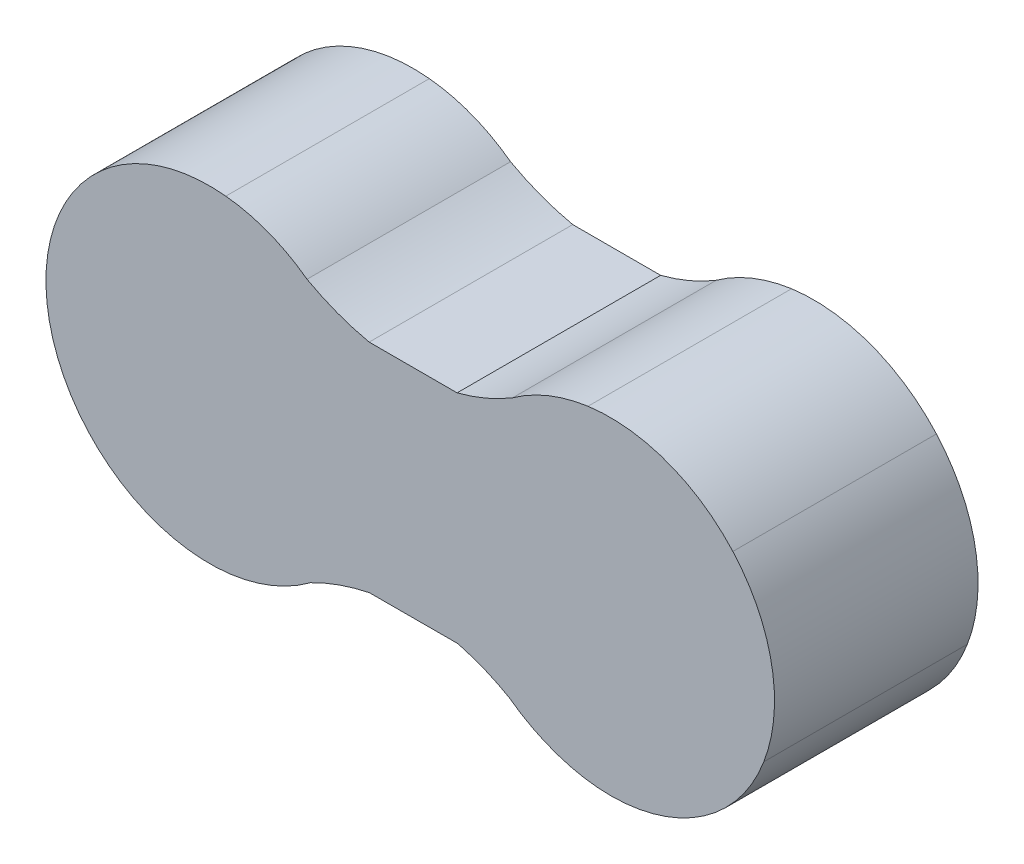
ISO-10303-21;
HEADER;
FILE_DESCRIPTION(('STEP AP214'),'2;1');
FILE_NAME('part.step','',(''),(''),'','','');
FILE_SCHEMA(('AUTOMOTIVE_DESIGN { 1 0 10303 214 1 1 1 1 }'));
ENDSEC;
DATA;
#1=APPLICATION_CONTEXT('core data for automotive mechanical design processes');
#2=APPLICATION_PROTOCOL_DEFINITION('international standard','automotive_design',2000,#1);
#3=PRODUCT_CONTEXT('',#1,'mechanical');
#4=PRODUCT('Part','Part','',(#3));
#5=PRODUCT_RELATED_PRODUCT_CATEGORY('part','',(#4));
#6=PRODUCT_DEFINITION_FORMATION('','',#4);
#7=PRODUCT_DEFINITION_CONTEXT('part definition',#1,'design');
#8=PRODUCT_DEFINITION('design','',#6,#7);
#9=PRODUCT_DEFINITION_SHAPE('','',#8);
#10=(LENGTH_UNIT() NAMED_UNIT(*) SI_UNIT(.MILLI.,.METRE.));
#11=(NAMED_UNIT(*) PLANE_ANGLE_UNIT() SI_UNIT($,.RADIAN.));
#12=(NAMED_UNIT(*) SI_UNIT($,.STERADIAN.) SOLID_ANGLE_UNIT());
#13=UNCERTAINTY_MEASURE_WITH_UNIT(LENGTH_MEASURE(1.E-05),#10,'distance_accuracy_value','');
#14=(GEOMETRIC_REPRESENTATION_CONTEXT(3) GLOBAL_UNCERTAINTY_ASSIGNED_CONTEXT((#13)) GLOBAL_UNIT_ASSIGNED_CONTEXT((#10,
#11,#12)) REPRESENTATION_CONTEXT('',''));
#15=CARTESIAN_POINT('',(0.,0.,0.));
#16=DIRECTION('',(0.,0.,1.));
#17=DIRECTION('',(1.,0.,0.));
#18=AXIS2_PLACEMENT_3D('',#15,#16,#17);
#19=CARTESIAN_POINT('',(0.,0.,0.508));
#20=DIRECTION('',(0.,0.,1.));
#21=DIRECTION('',(1.,0.,0.));
#22=AXIS2_PLACEMENT_3D('',#19,#20,#21);
#23=PLANE('',#22);
#24=CARTESIAN_POINT('',(0.0182368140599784,0.824100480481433,0.508));
#25=DIRECTION('',(0.,0.,1.));
#26=DIRECTION('',(1.,0.,0.));
#27=AXIS2_PLACEMENT_3D('',#24,#25,#26);
#28=CIRCLE('',#27,0.567659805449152);
#29=CARTESIAN_POINT('',(-0.256661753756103,0.327443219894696,0.508));
#30=VERTEX_POINT('',#29);
#31=CARTESIAN_POINT('',(-0.101460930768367,0.2692039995,0.508));
#32=VERTEX_POINT('',#31);
#33=EDGE_CURVE('E246',#30,#32,#28,.T.);
#34=ORIENTED_EDGE('',*,*,#33,.F.);
#35=CARTESIAN_POINT('',(-0.499437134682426,0.000317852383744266,0.508));
#36=DIRECTION('',(0.,0.,1.));
#37=DIRECTION('',(1.,0.,0.));
#38=AXIS2_PLACEMENT_3D('',#35,#36,#37);
#39=CIRCLE('',#38,0.407370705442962);
#40=CARTESIAN_POINT('',(-0.459355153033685,0.405711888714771,0.508));
#41=VERTEX_POINT('',#40);
#42=EDGE_CURVE('E251',#41,#30,#39,.F.);
#43=ORIENTED_EDGE('',*,*,#42,.F.);
#44=CARTESIAN_POINT('',(-0.500191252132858,0.00113089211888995,0.508));
#45=DIRECTION('',(0.,0.,1.));
#46=DIRECTION('',(1.,0.,0.));
#47=AXIS2_PLACEMENT_3D('',#44,#45,#46);
#48=CIRCLE('',#47,0.406636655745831);
#49=CARTESIAN_POINT('',(-0.77121801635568,0.304277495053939,0.508));
#50=VERTEX_POINT('',#49);
#51=EDGE_CURVE('E181',#50,#41,#48,.F.);
#52=ORIENTED_EDGE('',*,*,#51,.F.);
#53=CARTESIAN_POINT('',(-0.497390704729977,-0.0020015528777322,0.508));
#54=DIRECTION('',(0.,0.,1.));
#55=DIRECTION('',(1.,0.,0.));
#56=AXIS2_PLACEMENT_3D('',#53,#54,#55);
#57=CIRCLE('',#56,0.410838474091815);
#58=CARTESIAN_POINT('',(-0.907425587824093,0.0236820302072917,0.508));
#59=VERTEX_POINT('',#58);
#60=EDGE_CURVE('E178',#59,#50,#57,.F.);
#61=ORIENTED_EDGE('',*,*,#60,.F.);
#62=CARTESIAN_POINT('',(-0.502358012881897,-0.00169041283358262,0.508));
#63=DIRECTION('',(0.,0.,1.));
#64=DIRECTION('',(1.,0.,0.));
#65=AXIS2_PLACEMENT_3D('',#62,#63,#64);
#66=CIRCLE('',#65,0.405861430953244);
#67=CARTESIAN_POINT('',(-0.826003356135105,-0.246592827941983,0.508));
#68=VERTEX_POINT('',#67);
#69=EDGE_CURVE('E172',#68,#59,#66,.F.);
#70=ORIENTED_EDGE('',*,*,#69,.F.);
#71=CARTESIAN_POINT('',(-0.499808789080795,0.00023858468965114,0.508));
#72=DIRECTION('',(0.,0.,1.));
#73=DIRECTION('',(1.,0.,0.));
#74=AXIS2_PLACEMENT_3D('',#71,#72,#73);
#75=CIRCLE('',#74,0.409058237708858);
#76=CARTESIAN_POINT('',(-0.377106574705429,-0.389982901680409,0.508));
#77=VERTEX_POINT('',#76);
#78=EDGE_CURVE('E188',#77,#68,#75,.F.);
#79=ORIENTED_EDGE('',*,*,#78,.F.);
#80=CARTESIAN_POINT('',(-0.507623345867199,0.0250906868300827,0.508));
#81=DIRECTION('',(0.,0.,1.));
#82=DIRECTION('',(1.,0.,0.));
#83=AXIS2_PLACEMENT_3D('',#80,#81,#82);
#84=CIRCLE('',#83,0.435109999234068);
#85=CARTESIAN_POINT('',(-0.247996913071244,-0.324072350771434,0.508));
#86=VERTEX_POINT('',#85);
#87=EDGE_CURVE('E193',#86,#77,#84,.F.);
#88=ORIENTED_EDGE('',*,*,#87,.F.);
#89=CARTESIAN_POINT('',(0.0161157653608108,-0.83823216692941,0.508));
#90=DIRECTION('',(0.,0.,1.));
#91=DIRECTION('',(1.,0.,0.));
#92=AXIS2_PLACEMENT_3D('',#89,#90,#91);
#93=CIRCLE('',#92,0.578027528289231);
#94=CARTESIAN_POINT('',(-0.101053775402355,-0.272204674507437,0.508));
#95=VERTEX_POINT('',#94);
#96=EDGE_CURVE('E198',#95,#86,#93,.T.);
#97=ORIENTED_EDGE('',*,*,#96,.F.);
#98=DIRECTION('',(0.999998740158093,0.00158735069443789,0.));
#99=VECTOR('',#98,1.);
#100=CARTESIAN_POINT('',(0.000431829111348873,-0.272043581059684,0.508));
#101=LINE('',#100,#99);
#102=CARTESIAN_POINT('',(0.118359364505,-0.271856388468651,0.508));
#103=VERTEX_POINT('',#102);
#104=EDGE_CURVE('E45',#95,#103,#101,.T.);
#105=ORIENTED_EDGE('',*,*,#104,.T.);
#106=DIRECTION('',(-0.970621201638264,0.240612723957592,0.));
#107=VECTOR('',#106,1.);
#108=CARTESIAN_POINT('',(-0.0566380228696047,-0.228475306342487,0.508));
#109=LINE('',#108,#107);
#110=CARTESIAN_POINT('',(0.126297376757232,-0.27382418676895,0.508));
#111=VERTEX_POINT('',#110);
#112=EDGE_CURVE('E259',#111,#103,#109,.T.);
#113=ORIENTED_EDGE('',*,*,#112,.F.);
#114=CARTESIAN_POINT('',(-0.00517046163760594,-0.760123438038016,0.508));
#115=DIRECTION('',(0.,0.,1.));
#116=DIRECTION('',(1.,0.,0.));
#117=AXIS2_PLACEMENT_3D('',#114,#115,#116);
#118=CIRCLE('',#117,0.503756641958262);
#119=CARTESIAN_POINT('',(0.248431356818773,-0.324857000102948,0.508));
#120=VERTEX_POINT('',#119);
#121=EDGE_CURVE('E208',#120,#111,#118,.T.);
#122=ORIENTED_EDGE('',*,*,#121,.F.);
#123=CARTESIAN_POINT('',(0.510088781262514,0.0305427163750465,0.508));
#124=DIRECTION('',(0.,0.,1.));
#125=DIRECTION('',(1.,0.,0.));
#126=AXIS2_PLACEMENT_3D('',#123,#124,#125);
#127=CIRCLE('',#126,0.441331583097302);
#128=CARTESIAN_POINT('',(0.432146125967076,-0.403851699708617,0.508));
#129=VERTEX_POINT('',#128);
#130=EDGE_CURVE('E213',#129,#120,#127,.F.);
#131=ORIENTED_EDGE('',*,*,#130,.F.);
#132=CARTESIAN_POINT('',(0.501574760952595,-0.00203217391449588,0.508));
#133=DIRECTION('',(0.,0.,1.));
#134=DIRECTION('',(1.,0.,0.));
#135=AXIS2_PLACEMENT_3D('',#132,#133,#134);
#136=CIRCLE('',#135,0.407773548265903);
#137=CARTESIAN_POINT('',(0.883257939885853,-0.145549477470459,0.508));
#138=VERTEX_POINT('',#137);
#139=EDGE_CURVE('E218',#138,#129,#136,.F.);
#140=ORIENTED_EDGE('',*,*,#139,.F.);
#141=CARTESIAN_POINT('',(0.504549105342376,-0.000572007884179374,0.508));
#142=DIRECTION('',(0.,0.,1.));
#143=DIRECTION('',(1.,0.,0.));
#144=AXIS2_PLACEMENT_3D('',#141,#142,#143);
#145=CIRCLE('',#144,0.405510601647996);
#146=CARTESIAN_POINT('',(0.806122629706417,0.270522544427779,0.508));
#147=VERTEX_POINT('',#146);
#148=EDGE_CURVE('E223',#147,#138,#145,.F.);
#149=ORIENTED_EDGE('',*,*,#148,.F.);
#150=CARTESIAN_POINT('',(0.499850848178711,-0.00386322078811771,0.508));
#151=DIRECTION('',(0.,0.,1.));
#152=DIRECTION('',(1.,0.,0.));
#153=AXIS2_PLACEMENT_3D('',#150,#151,#152);
#154=CIRCLE('',#153,0.411205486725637);
#155=CARTESIAN_POINT('',(0.444609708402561,0.40361483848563,0.508));
#156=VERTEX_POINT('',#155);
#157=EDGE_CURVE('E228',#156,#147,#154,.F.);
#158=ORIENTED_EDGE('',*,*,#157,.F.);
#159=CARTESIAN_POINT('',(0.505062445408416,-0.017947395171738,0.508));
#160=DIRECTION('',(0.,0.,1.));
#161=DIRECTION('',(1.,0.,0.));
#162=AXIS2_PLACEMENT_3D('',#159,#160,#161);
#163=CIRCLE('',#162,0.425874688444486);
#164=CARTESIAN_POINT('',(0.25644625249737,0.327825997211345,0.508));
#165=VERTEX_POINT('',#164);
#166=EDGE_CURVE('E233',#165,#156,#163,.F.);
#167=ORIENTED_EDGE('',*,*,#166,.F.);
#168=CARTESIAN_POINT('',(-0.012667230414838,0.770844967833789,0.508));
#169=DIRECTION('',(0.,0.,1.));
#170=DIRECTION('',(1.,0.,0.));
#171=AXIS2_PLACEMENT_3D('',#168,#169,#170);
#172=CIRCLE('',#171,0.51835111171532);
#173=CARTESIAN_POINT('',(0.117886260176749,0.2692039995,0.508));
#174=VERTEX_POINT('',#173);
#175=EDGE_CURVE('E238',#174,#165,#172,.T.);
#176=ORIENTED_EDGE('',*,*,#175,.F.);
#177=DIRECTION('',(1.,0.,0.));
#178=VECTOR('',#177,1.);
#179=CARTESIAN_POINT('',(0.,0.2692039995,0.508));
#180=LINE('',#179,#178);
#181=EDGE_CURVE('E243',#32,#174,#180,.T.);
#182=ORIENTED_EDGE('',*,*,#181,.F.);
#183=EDGE_LOOP('',(#34,#43,#52,#61,#70,#79,#88,#97,#105,#113,#122,#131,#140,#149,#158,#167,#176,#182));
#184=FACE_BOUND('',#183,.T.);
#185=ADVANCED_FACE('F35',(#184),#23,.T.);
#186=CARTESIAN_POINT('',(0.0182368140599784,0.824100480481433,-1.9936311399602));
#187=DIRECTION('',(0.,0.,1.));
#188=DIRECTION('',(1.,0.,0.));
#189=AXIS2_PLACEMENT_3D('',#186,#187,#188);
#190=CYLINDRICAL_SURFACE('',#189,0.567659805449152);
#191=DIRECTION('',(0.,0.,1.));
#192=VECTOR('',#191,1.);
#193=CARTESIAN_POINT('',(-0.101460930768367,0.2692039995,-1.9936311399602));
#194=LINE('',#193,#192);
#195=CARTESIAN_POINT('',(-0.101460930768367,0.2692039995,0.));
#196=VERTEX_POINT('',#195);
#197=EDGE_CURVE('E245',#196,#32,#194,.T.);
#198=ORIENTED_EDGE('',*,*,#197,.F.);
#199=CARTESIAN_POINT('',(0.0182368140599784,0.824100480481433,0.));
#200=DIRECTION('',(0.,0.,1.));
#201=DIRECTION('',(1.,0.,0.));
#202=AXIS2_PLACEMENT_3D('',#199,#200,#201);
#203=CIRCLE('',#202,0.567659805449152);
#204=CARTESIAN_POINT('',(-0.256661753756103,0.327443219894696,0.));
#205=VERTEX_POINT('',#204);
#206=EDGE_CURVE('E54',#196,#205,#203,.F.);
#207=ORIENTED_EDGE('',*,*,#206,.T.);
#208=DIRECTION('',(0.,0.,1.));
#209=VECTOR('',#208,1.);
#210=CARTESIAN_POINT('',(-0.256661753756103,0.327443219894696,-1.9936311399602));
#211=LINE('',#210,#209);
#212=EDGE_CURVE('E248',#205,#30,#211,.T.);
#213=ORIENTED_EDGE('',*,*,#212,.T.);
#214=ORIENTED_EDGE('',*,*,#33,.T.);
#215=EDGE_LOOP('',(#198,#207,#213,#214));
#216=FACE_BOUND('',#215,.T.);
#217=ADVANCED_FACE('F361',(#216),#190,.F.);
#218=CARTESIAN_POINT('',(0.,0.2692039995,-1.9936311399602));
#219=DIRECTION('',(0.,-1.,0.));
#220=DIRECTION('',(0.,0.,-1.));
#221=AXIS2_PLACEMENT_3D('',#218,#219,#220);
#222=PLANE('',#221);
#223=DIRECTION('',(0.,0.,1.));
#224=VECTOR('',#223,1.);
#225=CARTESIAN_POINT('',(0.117886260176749,0.2692039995,-1.9936311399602));
#226=LINE('',#225,#224);
#227=CARTESIAN_POINT('',(0.117886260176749,0.2692039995,0.));
#228=VERTEX_POINT('',#227);
#229=EDGE_CURVE('E242',#228,#174,#226,.T.);
#230=ORIENTED_EDGE('',*,*,#229,.F.);
#231=DIRECTION('',(-1.,0.,0.));
#232=VECTOR('',#231,1.);
#233=CARTESIAN_POINT('',(0.,0.2692039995,0.));
#234=LINE('',#233,#232);
#235=EDGE_CURVE('E123',#228,#196,#234,.T.);
#236=ORIENTED_EDGE('',*,*,#235,.T.);
#237=ORIENTED_EDGE('',*,*,#197,.T.);
#238=ORIENTED_EDGE('',*,*,#181,.T.);
#239=EDGE_LOOP('',(#230,#236,#237,#238));
#240=FACE_BOUND('',#239,.T.);
#241=ADVANCED_FACE('F303',(#240),#222,.F.);
#242=CARTESIAN_POINT('',(-0.012667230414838,0.770844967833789,-1.9936311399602));
#243=DIRECTION('',(0.,0.,1.));
#244=DIRECTION('',(1.,0.,0.));
#245=AXIS2_PLACEMENT_3D('',#242,#243,#244);
#246=CYLINDRICAL_SURFACE('',#245,0.51835111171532);
#247=DIRECTION('',(0.,0.,1.));
#248=VECTOR('',#247,1.);
#249=CARTESIAN_POINT('',(0.25644625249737,0.327825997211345,-1.9936311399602));
#250=LINE('',#249,#248);
#251=CARTESIAN_POINT('',(0.25644625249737,0.327825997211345,0.));
#252=VERTEX_POINT('',#251);
#253=EDGE_CURVE('E237',#252,#165,#250,.T.);
#254=ORIENTED_EDGE('',*,*,#253,.F.);
#255=CARTESIAN_POINT('',(-0.012667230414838,0.770844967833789,0.));
#256=DIRECTION('',(0.,0.,1.));
#257=DIRECTION('',(1.,0.,0.));
#258=AXIS2_PLACEMENT_3D('',#255,#256,#257);
#259=CIRCLE('',#258,0.51835111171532);
#260=EDGE_CURVE('E239',#252,#228,#259,.F.);
#261=ORIENTED_EDGE('',*,*,#260,.T.);
#262=ORIENTED_EDGE('',*,*,#229,.T.);
#263=ORIENTED_EDGE('',*,*,#175,.T.);
#264=EDGE_LOOP('',(#254,#261,#262,#263));
#265=FACE_BOUND('',#264,.T.);
#266=ADVANCED_FACE('F310',(#265),#246,.F.);
#267=CARTESIAN_POINT('',(0.505062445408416,-0.017947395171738,-1.9936311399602));
#268=DIRECTION('',(0.,0.,1.));
#269=DIRECTION('',(1.,0.,0.));
#270=AXIS2_PLACEMENT_3D('',#267,#268,#269);
#271=CYLINDRICAL_SURFACE('',#270,0.425874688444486);
#272=DIRECTION('',(0.,0.,1.));
#273=VECTOR('',#272,1.);
#274=CARTESIAN_POINT('',(0.444609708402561,0.40361483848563,-1.9936311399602));
#275=LINE('',#274,#273);
#276=CARTESIAN_POINT('',(0.444609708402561,0.40361483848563,0.));
#277=VERTEX_POINT('',#276);
#278=EDGE_CURVE('E232',#277,#156,#275,.T.);
#279=ORIENTED_EDGE('',*,*,#278,.F.);
#280=CARTESIAN_POINT('',(0.505062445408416,-0.017947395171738,0.));
#281=DIRECTION('',(0.,0.,1.));
#282=DIRECTION('',(1.,0.,0.));
#283=AXIS2_PLACEMENT_3D('',#280,#281,#282);
#284=CIRCLE('',#283,0.425874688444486);
#285=EDGE_CURVE('E234',#277,#252,#284,.T.);
#286=ORIENTED_EDGE('',*,*,#285,.T.);
#287=ORIENTED_EDGE('',*,*,#253,.T.);
#288=ORIENTED_EDGE('',*,*,#166,.T.);
#289=EDGE_LOOP('',(#279,#286,#287,#288));
#290=FACE_BOUND('',#289,.T.);
#291=ADVANCED_FACE('F314',(#290),#271,.T.);
#292=CARTESIAN_POINT('',(0.499850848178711,-0.00386322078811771,-1.9936311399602));
#293=DIRECTION('',(0.,0.,1.));
#294=DIRECTION('',(1.,0.,0.));
#295=AXIS2_PLACEMENT_3D('',#292,#293,#294);
#296=CYLINDRICAL_SURFACE('',#295,0.411205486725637);
#297=DIRECTION('',(0.,0.,1.));
#298=VECTOR('',#297,1.);
#299=CARTESIAN_POINT('',(0.806122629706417,0.270522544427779,-1.9936311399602));
#300=LINE('',#299,#298);
#301=CARTESIAN_POINT('',(0.806122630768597,0.270522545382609,0.));
#302=VERTEX_POINT('',#301);
#303=EDGE_CURVE('E227',#302,#147,#300,.T.);
#304=ORIENTED_EDGE('',*,*,#303,.F.);
#305=CARTESIAN_POINT('',(0.499850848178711,-0.00386322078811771,0.));
#306=DIRECTION('',(0.,0.,1.));
#307=DIRECTION('',(1.,0.,0.));
#308=AXIS2_PLACEMENT_3D('',#305,#306,#307);
#309=CIRCLE('',#308,0.411205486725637);
#310=EDGE_CURVE('E229',#302,#277,#309,.T.);
#311=ORIENTED_EDGE('',*,*,#310,.T.);
#312=ORIENTED_EDGE('',*,*,#278,.T.);
#313=ORIENTED_EDGE('',*,*,#157,.T.);
#314=EDGE_LOOP('',(#304,#311,#312,#313));
#315=FACE_BOUND('',#314,.T.);
#316=ADVANCED_FACE('F316',(#315),#296,.T.);
#317=CARTESIAN_POINT('',(0.504549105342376,-0.000572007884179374,-1.9936311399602));
#318=DIRECTION('',(0.,0.,1.));
#319=DIRECTION('',(1.,0.,0.));
#320=AXIS2_PLACEMENT_3D('',#317,#318,#319);
#321=CYLINDRICAL_SURFACE('',#320,0.405510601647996);
#322=DIRECTION('',(0.,0.,1.));
#323=VECTOR('',#322,1.);
#324=CARTESIAN_POINT('',(0.883257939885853,-0.145549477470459,-1.9936311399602));
#325=LINE('',#324,#323);
#326=CARTESIAN_POINT('',(0.883257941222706,-0.145549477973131,0.));
#327=VERTEX_POINT('',#326);
#328=EDGE_CURVE('E222',#327,#138,#325,.T.);
#329=ORIENTED_EDGE('',*,*,#328,.F.);
#330=CARTESIAN_POINT('',(0.504549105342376,-0.000572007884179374,0.));
#331=DIRECTION('',(0.,0.,1.));
#332=DIRECTION('',(1.,0.,0.));
#333=AXIS2_PLACEMENT_3D('',#330,#331,#332);
#334=CIRCLE('',#333,0.405510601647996);
#335=EDGE_CURVE('E224',#327,#302,#334,.T.);
#336=ORIENTED_EDGE('',*,*,#335,.T.);
#337=ORIENTED_EDGE('',*,*,#303,.T.);
#338=ORIENTED_EDGE('',*,*,#148,.T.);
#339=EDGE_LOOP('',(#329,#336,#337,#338));
#340=FACE_BOUND('',#339,.T.);
#341=ADVANCED_FACE('F320',(#340),#321,.T.);
#342=CARTESIAN_POINT('',(0.501574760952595,-0.00203217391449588,-1.9936311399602));
#343=DIRECTION('',(0.,0.,1.));
#344=DIRECTION('',(1.,0.,0.));
#345=AXIS2_PLACEMENT_3D('',#342,#343,#344);
#346=CYLINDRICAL_SURFACE('',#345,0.407773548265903);
#347=DIRECTION('',(0.,0.,1.));
#348=VECTOR('',#347,1.);
#349=CARTESIAN_POINT('',(0.432146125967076,-0.403851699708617,-1.9936311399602));
#350=LINE('',#349,#348);
#351=CARTESIAN_POINT('',(0.432146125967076,-0.403851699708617,0.));
#352=VERTEX_POINT('',#351);
#353=EDGE_CURVE('E217',#352,#129,#350,.T.);
#354=ORIENTED_EDGE('',*,*,#353,.F.);
#355=CARTESIAN_POINT('',(0.501574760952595,-0.00203217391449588,0.));
#356=DIRECTION('',(0.,0.,1.));
#357=DIRECTION('',(1.,0.,0.));
#358=AXIS2_PLACEMENT_3D('',#355,#356,#357);
#359=CIRCLE('',#358,0.407773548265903);
#360=EDGE_CURVE('E219',#352,#327,#359,.T.);
#361=ORIENTED_EDGE('',*,*,#360,.T.);
#362=ORIENTED_EDGE('',*,*,#328,.T.);
#363=ORIENTED_EDGE('',*,*,#139,.T.);
#364=EDGE_LOOP('',(#354,#361,#362,#363));
#365=FACE_BOUND('',#364,.T.);
#366=ADVANCED_FACE('F324',(#365),#346,.T.);
#367=CARTESIAN_POINT('',(0.510088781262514,0.0305427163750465,-1.9936311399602));
#368=DIRECTION('',(0.,0.,1.));
#369=DIRECTION('',(1.,0.,0.));
#370=AXIS2_PLACEMENT_3D('',#367,#368,#369);
#371=CYLINDRICAL_SURFACE('',#370,0.441331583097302);
#372=DIRECTION('',(0.,0.,1.));
#373=VECTOR('',#372,1.);
#374=CARTESIAN_POINT('',(0.248431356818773,-0.324857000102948,-1.9936311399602));
#375=LINE('',#374,#373);
#376=CARTESIAN_POINT('',(0.248431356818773,-0.324857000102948,0.));
#377=VERTEX_POINT('',#376);
#378=EDGE_CURVE('E212',#377,#120,#375,.T.);
#379=ORIENTED_EDGE('',*,*,#378,.F.);
#380=CARTESIAN_POINT('',(0.510088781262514,0.0305427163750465,0.));
#381=DIRECTION('',(0.,0.,1.));
#382=DIRECTION('',(1.,0.,0.));
#383=AXIS2_PLACEMENT_3D('',#380,#381,#382);
#384=CIRCLE('',#383,0.441331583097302);
#385=EDGE_CURVE('E214',#377,#352,#384,.T.);
#386=ORIENTED_EDGE('',*,*,#385,.T.);
#387=ORIENTED_EDGE('',*,*,#353,.T.);
#388=ORIENTED_EDGE('',*,*,#130,.T.);
#389=EDGE_LOOP('',(#379,#386,#387,#388));
#390=FACE_BOUND('',#389,.T.);
#391=ADVANCED_FACE('F328',(#390),#371,.T.);
#392=CARTESIAN_POINT('',(-0.00517046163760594,-0.760123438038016,-1.9936311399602));
#393=DIRECTION('',(0.,0.,1.));
#394=DIRECTION('',(1.,0.,0.));
#395=AXIS2_PLACEMENT_3D('',#392,#393,#394);
#396=CYLINDRICAL_SURFACE('',#395,0.503756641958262);
#397=DIRECTION('',(0.,0.,1.));
#398=VECTOR('',#397,1.);
#399=CARTESIAN_POINT('',(0.126297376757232,-0.27382418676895,-1.9936311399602));
#400=LINE('',#399,#398);
#401=CARTESIAN_POINT('',(0.126297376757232,-0.27382418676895,0.));
#402=VERTEX_POINT('',#401);
#403=EDGE_CURVE('E207',#402,#111,#400,.T.);
#404=ORIENTED_EDGE('',*,*,#403,.F.);
#405=CARTESIAN_POINT('',(-0.00517046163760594,-0.760123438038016,0.));
#406=DIRECTION('',(0.,0.,1.));
#407=DIRECTION('',(1.,0.,0.));
#408=AXIS2_PLACEMENT_3D('',#405,#406,#407);
#409=CIRCLE('',#408,0.503756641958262);
#410=EDGE_CURVE('E209',#402,#377,#409,.F.);
#411=ORIENTED_EDGE('',*,*,#410,.T.);
#412=ORIENTED_EDGE('',*,*,#378,.T.);
#413=ORIENTED_EDGE('',*,*,#121,.T.);
#414=EDGE_LOOP('',(#404,#411,#412,#413));
#415=FACE_BOUND('',#414,.T.);
#416=ADVANCED_FACE('F332',(#415),#396,.F.);
#417=CARTESIAN_POINT('',(-0.0566380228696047,-0.228475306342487,-1.9936311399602));
#418=DIRECTION('',(0.240612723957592,0.970621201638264,0.));
#419=DIRECTION('',(-0.970621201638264,0.240612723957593,0.));
#420=AXIS2_PLACEMENT_3D('',#417,#418,#419);
#421=PLANE('',#420);
#422=DIRECTION('',(0.,0.,1.));
#423=VECTOR('',#422,1.);
#424=CARTESIAN_POINT('',(0.118359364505,-0.271856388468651,-1.9936311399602));
#425=LINE('',#424,#423);
#426=CARTESIAN_POINT('',(0.118359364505,-0.271856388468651,0.));
#427=VERTEX_POINT('',#426);
#428=EDGE_CURVE('E202',#427,#103,#425,.T.);
#429=ORIENTED_EDGE('',*,*,#428,.F.);
#430=DIRECTION('',(0.970621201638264,-0.240612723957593,0.));
#431=VECTOR('',#430,1.);
#432=CARTESIAN_POINT('',(-0.0566380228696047,-0.228475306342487,0.));
#433=LINE('',#432,#431);
#434=EDGE_CURVE('E204',#427,#402,#433,.T.);
#435=ORIENTED_EDGE('',*,*,#434,.T.);
#436=ORIENTED_EDGE('',*,*,#403,.T.);
#437=ORIENTED_EDGE('',*,*,#112,.T.);
#438=EDGE_LOOP('',(#429,#435,#436,#437));
#439=FACE_BOUND('',#438,.T.);
#440=ADVANCED_FACE('F337',(#439),#421,.F.);
#441=CARTESIAN_POINT('',(0.000431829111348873,-0.272043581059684,-1.9936311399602));
#442=DIRECTION('',(0.00158735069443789,-0.999998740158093,0.));
#443=DIRECTION('',(0.999998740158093,0.00158735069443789,0.));
#444=AXIS2_PLACEMENT_3D('',#441,#442,#443);
#445=PLANE('',#444);
#446=DIRECTION('',(-0.999998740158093,-0.00158735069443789,0.));
#447=VECTOR('',#446,1.);
#448=CARTESIAN_POINT('',(0.000431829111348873,-0.272043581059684,0.));
#449=LINE('',#448,#447);
#450=CARTESIAN_POINT('',(-0.101053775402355,-0.272204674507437,0.));
#451=VERTEX_POINT('',#450);
#452=EDGE_CURVE('E11',#427,#451,#449,.T.);
#453=ORIENTED_EDGE('',*,*,#452,.F.);
#454=ORIENTED_EDGE('',*,*,#428,.T.);
#455=ORIENTED_EDGE('',*,*,#104,.F.);
#456=DIRECTION('',(0.,0.,1.));
#457=VECTOR('',#456,1.);
#458=CARTESIAN_POINT('',(-0.101053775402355,-0.272204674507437,-1.9936311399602));
#459=LINE('',#458,#457);
#460=EDGE_CURVE('E201',#451,#95,#459,.T.);
#461=ORIENTED_EDGE('',*,*,#460,.F.);
#462=EDGE_LOOP('',(#453,#454,#455,#461));
#463=FACE_BOUND('',#462,.T.);
#464=ADVANCED_FACE('F341',(#463),#445,.T.);
#465=CARTESIAN_POINT('',(0.0161157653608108,-0.83823216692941,-1.9936311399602));
#466=DIRECTION('',(0.,0.,1.));
#467=DIRECTION('',(1.,0.,0.));
#468=AXIS2_PLACEMENT_3D('',#465,#466,#467);
#469=CYLINDRICAL_SURFACE('',#468,0.578027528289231);
#470=DIRECTION('',(0.,0.,1.));
#471=VECTOR('',#470,1.);
#472=CARTESIAN_POINT('',(-0.247996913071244,-0.324072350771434,-1.9936311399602));
#473=LINE('',#472,#471);
#474=CARTESIAN_POINT('',(-0.247996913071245,-0.324072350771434,0.));
#475=VERTEX_POINT('',#474);
#476=EDGE_CURVE('E197',#475,#86,#473,.T.);
#477=ORIENTED_EDGE('',*,*,#476,.F.);
#478=CARTESIAN_POINT('',(0.0161157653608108,-0.83823216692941,0.));
#479=DIRECTION('',(0.,0.,1.));
#480=DIRECTION('',(1.,0.,0.));
#481=AXIS2_PLACEMENT_3D('',#478,#479,#480);
#482=CIRCLE('',#481,0.578027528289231);
#483=EDGE_CURVE('E199',#475,#451,#482,.F.);
#484=ORIENTED_EDGE('',*,*,#483,.T.);
#485=ORIENTED_EDGE('',*,*,#460,.T.);
#486=ORIENTED_EDGE('',*,*,#96,.T.);
#487=EDGE_LOOP('',(#477,#484,#485,#486));
#488=FACE_BOUND('',#487,.T.);
#489=ADVANCED_FACE('F345',(#488),#469,.F.);
#490=CARTESIAN_POINT('',(-0.507623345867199,0.0250906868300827,-1.9936311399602));
#491=DIRECTION('',(0.,0.,1.));
#492=DIRECTION('',(1.,0.,0.));
#493=AXIS2_PLACEMENT_3D('',#490,#491,#492);
#494=CYLINDRICAL_SURFACE('',#493,0.435109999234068);
#495=DIRECTION('',(0.,0.,1.));
#496=VECTOR('',#495,1.);
#497=CARTESIAN_POINT('',(-0.377106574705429,-0.389982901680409,-1.9936311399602));
#498=LINE('',#497,#496);
#499=CARTESIAN_POINT('',(-0.377106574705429,-0.389982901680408,0.));
#500=VERTEX_POINT('',#499);
#501=EDGE_CURVE('E192',#500,#77,#498,.T.);
#502=ORIENTED_EDGE('',*,*,#501,.F.);
#503=CARTESIAN_POINT('',(-0.507623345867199,0.0250906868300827,0.));
#504=DIRECTION('',(0.,0.,1.));
#505=DIRECTION('',(1.,0.,0.));
#506=AXIS2_PLACEMENT_3D('',#503,#504,#505);
#507=CIRCLE('',#506,0.435109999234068);
#508=EDGE_CURVE('E194',#500,#475,#507,.T.);
#509=ORIENTED_EDGE('',*,*,#508,.T.);
#510=ORIENTED_EDGE('',*,*,#476,.T.);
#511=ORIENTED_EDGE('',*,*,#87,.T.);
#512=EDGE_LOOP('',(#502,#509,#510,#511));
#513=FACE_BOUND('',#512,.T.);
#514=ADVANCED_FACE('F349',(#513),#494,.T.);
#515=CARTESIAN_POINT('',(-0.499808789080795,0.00023858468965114,-1.9936311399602));
#516=DIRECTION('',(0.,0.,1.));
#517=DIRECTION('',(1.,0.,0.));
#518=AXIS2_PLACEMENT_3D('',#515,#516,#517);
#519=CYLINDRICAL_SURFACE('',#518,0.409058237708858);
#520=DIRECTION('',(0.,0.,1.));
#521=VECTOR('',#520,1.);
#522=CARTESIAN_POINT('',(-0.826003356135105,-0.246592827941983,-1.9936311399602));
#523=LINE('',#522,#521);
#524=CARTESIAN_POINT('',(-0.826003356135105,-0.246592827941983,0.));
#525=VERTEX_POINT('',#524);
#526=EDGE_CURVE('E187',#525,#68,#523,.T.);
#527=ORIENTED_EDGE('',*,*,#526,.F.);
#528=CARTESIAN_POINT('',(-0.499808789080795,0.00023858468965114,0.));
#529=DIRECTION('',(0.,0.,1.));
#530=DIRECTION('',(1.,0.,0.));
#531=AXIS2_PLACEMENT_3D('',#528,#529,#530);
#532=CIRCLE('',#531,0.409058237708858);
#533=EDGE_CURVE('E189',#525,#500,#532,.T.);
#534=ORIENTED_EDGE('',*,*,#533,.T.);
#535=ORIENTED_EDGE('',*,*,#501,.T.);
#536=ORIENTED_EDGE('',*,*,#78,.T.);
#537=EDGE_LOOP('',(#527,#534,#535,#536));
#538=FACE_BOUND('',#537,.T.);
#539=ADVANCED_FACE('F353',(#538),#519,.T.);
#540=CARTESIAN_POINT('',(-0.502358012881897,-0.00169041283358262,-1.9936311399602));
#541=DIRECTION('',(0.,0.,1.));
#542=DIRECTION('',(1.,0.,0.));
#543=AXIS2_PLACEMENT_3D('',#540,#541,#542);
#544=CYLINDRICAL_SURFACE('',#543,0.405861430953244);
#545=DIRECTION('',(0.,0.,1.));
#546=VECTOR('',#545,1.);
#547=CARTESIAN_POINT('',(-0.907425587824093,0.0236820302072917,-1.9936311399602));
#548=LINE('',#547,#546);
#549=CARTESIAN_POINT('',(-0.907425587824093,0.0236820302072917,0.));
#550=VERTEX_POINT('',#549);
#551=EDGE_CURVE('E171',#550,#59,#548,.T.);
#552=ORIENTED_EDGE('',*,*,#551,.F.);
#553=CARTESIAN_POINT('',(-0.502358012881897,-0.00169041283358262,0.));
#554=DIRECTION('',(0.,0.,1.));
#555=DIRECTION('',(1.,0.,0.));
#556=AXIS2_PLACEMENT_3D('',#553,#554,#555);
#557=CIRCLE('',#556,0.405861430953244);
#558=EDGE_CURVE('E168',#550,#525,#557,.T.);
#559=ORIENTED_EDGE('',*,*,#558,.T.);
#560=ORIENTED_EDGE('',*,*,#526,.T.);
#561=ORIENTED_EDGE('',*,*,#69,.T.);
#562=EDGE_LOOP('',(#552,#559,#560,#561));
#563=FACE_BOUND('',#562,.T.);
#564=ADVANCED_FACE('F356',(#563),#544,.T.);
#565=CARTESIAN_POINT('',(-0.497390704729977,-0.0020015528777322,-1.9936311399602));
#566=DIRECTION('',(0.,0.,1.));
#567=DIRECTION('',(1.,0.,0.));
#568=AXIS2_PLACEMENT_3D('',#565,#566,#567);
#569=CYLINDRICAL_SURFACE('',#568,0.410838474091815);
#570=DIRECTION('',(0.,0.,1.));
#571=VECTOR('',#570,1.);
#572=CARTESIAN_POINT('',(-0.77121801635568,0.304277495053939,-1.9936311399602));
#573=LINE('',#572,#571);
#574=CARTESIAN_POINT('',(-0.77121801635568,0.304277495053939,0.));
#575=VERTEX_POINT('',#574);
#576=EDGE_CURVE('E175',#575,#50,#573,.T.);
#577=ORIENTED_EDGE('',*,*,#576,.F.);
#578=CARTESIAN_POINT('',(-0.497390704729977,-0.0020015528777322,0.));
#579=DIRECTION('',(0.,0.,1.));
#580=DIRECTION('',(1.,0.,0.));
#581=AXIS2_PLACEMENT_3D('',#578,#579,#580);
#582=CIRCLE('',#581,0.410838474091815);
#583=EDGE_CURVE('E163',#575,#550,#582,.T.);
#584=ORIENTED_EDGE('',*,*,#583,.T.);
#585=ORIENTED_EDGE('',*,*,#551,.T.);
#586=ORIENTED_EDGE('',*,*,#60,.T.);
#587=EDGE_LOOP('',(#577,#584,#585,#586));
#588=FACE_BOUND('',#587,.T.);
#589=ADVANCED_FACE('F176',(#588),#569,.T.);
#590=CARTESIAN_POINT('',(-0.500191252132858,0.00113089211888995,-1.9936311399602));
#591=DIRECTION('',(0.,0.,1.));
#592=DIRECTION('',(1.,0.,0.));
#593=AXIS2_PLACEMENT_3D('',#590,#591,#592);
#594=CYLINDRICAL_SURFACE('',#593,0.406636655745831);
#595=DIRECTION('',(0.,0.,1.));
#596=VECTOR('',#595,1.);
#597=CARTESIAN_POINT('',(-0.459355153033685,0.405711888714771,-1.9936311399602));
#598=LINE('',#597,#596);
#599=CARTESIAN_POINT('',(-0.459355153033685,0.405711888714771,0.));
#600=VERTEX_POINT('',#599);
#601=EDGE_CURVE('E117',#600,#41,#598,.T.);
#602=ORIENTED_EDGE('',*,*,#601,.F.);
#603=CARTESIAN_POINT('',(-0.500191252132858,0.00113089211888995,0.));
#604=DIRECTION('',(0.,0.,1.));
#605=DIRECTION('',(1.,0.,0.));
#606=AXIS2_PLACEMENT_3D('',#603,#604,#605);
#607=CIRCLE('',#606,0.406636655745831);
#608=EDGE_CURVE('E166',#600,#575,#607,.T.);
#609=ORIENTED_EDGE('',*,*,#608,.T.);
#610=ORIENTED_EDGE('',*,*,#576,.T.);
#611=ORIENTED_EDGE('',*,*,#51,.T.);
#612=EDGE_LOOP('',(#602,#609,#610,#611));
#613=FACE_BOUND('',#612,.T.);
#614=ADVANCED_FACE('F183',(#613),#594,.T.);
#615=CARTESIAN_POINT('',(-0.499437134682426,0.000317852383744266,-1.9936311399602));
#616=DIRECTION('',(0.,0.,1.));
#617=DIRECTION('',(1.,0.,0.));
#618=AXIS2_PLACEMENT_3D('',#615,#616,#617);
#619=CYLINDRICAL_SURFACE('',#618,0.407370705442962);
#620=ORIENTED_EDGE('',*,*,#212,.F.);
#621=CARTESIAN_POINT('',(-0.499437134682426,0.000317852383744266,0.));
#622=DIRECTION('',(0.,0.,1.));
#623=DIRECTION('',(1.,0.,0.));
#624=AXIS2_PLACEMENT_3D('',#621,#622,#623);
#625=CIRCLE('',#624,0.407370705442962);
#626=EDGE_CURVE('E39',#205,#600,#625,.T.);
#627=ORIENTED_EDGE('',*,*,#626,.T.);
#628=ORIENTED_EDGE('',*,*,#601,.T.);
#629=ORIENTED_EDGE('',*,*,#42,.T.);
#630=EDGE_LOOP('',(#620,#627,#628,#629));
#631=FACE_BOUND('',#630,.T.);
#632=ADVANCED_FACE('F359',(#631),#619,.T.);
#633=CARTESIAN_POINT('',(0.,0.,0.));
#634=DIRECTION('',(0.,0.,1.));
#635=DIRECTION('',(1.,0.,0.));
#636=AXIS2_PLACEMENT_3D('',#633,#634,#635);
#637=PLANE('',#636);
#638=ORIENTED_EDGE('',*,*,#235,.F.);
#639=ORIENTED_EDGE('',*,*,#260,.F.);
#640=ORIENTED_EDGE('',*,*,#285,.F.);
#641=ORIENTED_EDGE('',*,*,#310,.F.);
#642=ORIENTED_EDGE('',*,*,#335,.F.);
#643=ORIENTED_EDGE('',*,*,#360,.F.);
#644=ORIENTED_EDGE('',*,*,#385,.F.);
#645=ORIENTED_EDGE('',*,*,#410,.F.);
#646=ORIENTED_EDGE('',*,*,#434,.F.);
#647=ORIENTED_EDGE('',*,*,#452,.T.);
#648=ORIENTED_EDGE('',*,*,#483,.F.);
#649=ORIENTED_EDGE('',*,*,#508,.F.);
#650=ORIENTED_EDGE('',*,*,#533,.F.);
#651=ORIENTED_EDGE('',*,*,#558,.F.);
#652=ORIENTED_EDGE('',*,*,#583,.F.);
#653=ORIENTED_EDGE('',*,*,#608,.F.);
#654=ORIENTED_EDGE('',*,*,#626,.F.);
#655=ORIENTED_EDGE('',*,*,#206,.F.);
#656=EDGE_LOOP('',(#638,#639,#640,#641,#642,#643,#644,#645,#646,#647,#648,#649,#650,#651,#652,
#653,#654,#655));
#657=FACE_BOUND('',#656,.T.);
#658=ADVANCED_FACE('F37',(#657),#637,.F.);
#659=CLOSED_SHELL('',(#185,#217,#241,#266,#291,#316,#341,#366,#391,#416,#440,#464,#489,#514,
#539,#564,#589,#614,#632,#658));
#660=MANIFOLD_SOLID_BREP('B2',#659);
#661=ADVANCED_BREP_SHAPE_REPRESENTATION('',(#18,#660),#14);
#662=SHAPE_DEFINITION_REPRESENTATION(#9,#661);
ENDSEC;
END-ISO-10303-21;
